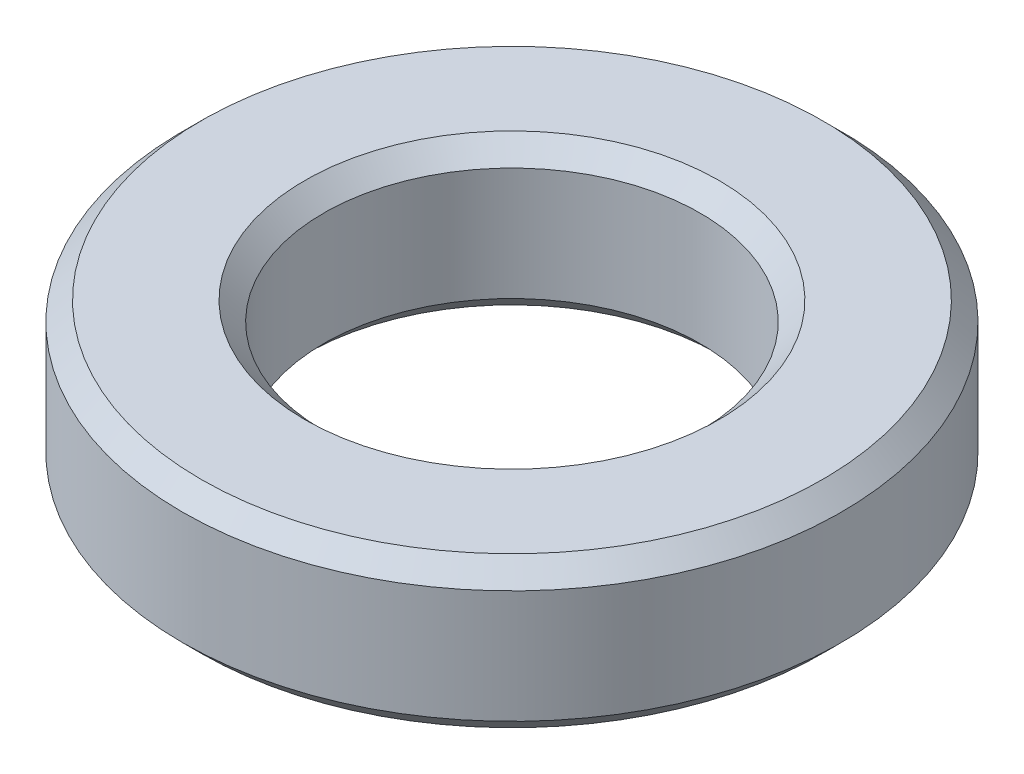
ISO-10303-21;
HEADER;
FILE_DESCRIPTION(('STEP AP214'),'2;1');
FILE_NAME('part.step','',(''),(''),'','','');
FILE_SCHEMA(('AUTOMOTIVE_DESIGN { 1 0 10303 214 1 1 1 1 }'));
ENDSEC;
DATA;
#1=APPLICATION_CONTEXT('core data for automotive mechanical design processes');
#2=APPLICATION_PROTOCOL_DEFINITION('international standard','automotive_design',2000,#1);
#3=PRODUCT_CONTEXT('',#1,'mechanical');
#4=PRODUCT('Part','Part','',(#3));
#5=PRODUCT_RELATED_PRODUCT_CATEGORY('part','',(#4));
#6=PRODUCT_DEFINITION_FORMATION('','',#4);
#7=PRODUCT_DEFINITION_CONTEXT('part definition',#1,'design');
#8=PRODUCT_DEFINITION('design','',#6,#7);
#9=PRODUCT_DEFINITION_SHAPE('','',#8);
#10=(LENGTH_UNIT() NAMED_UNIT(*) SI_UNIT(.MILLI.,.METRE.));
#11=(NAMED_UNIT(*) PLANE_ANGLE_UNIT() SI_UNIT($,.RADIAN.));
#12=(NAMED_UNIT(*) SI_UNIT($,.STERADIAN.) SOLID_ANGLE_UNIT());
#13=UNCERTAINTY_MEASURE_WITH_UNIT(LENGTH_MEASURE(1.E-05),#10,'distance_accuracy_value','');
#14=(GEOMETRIC_REPRESENTATION_CONTEXT(3) GLOBAL_UNCERTAINTY_ASSIGNED_CONTEXT((#13)) GLOBAL_UNIT_ASSIGNED_CONTEXT((#10,
#11,#12)) REPRESENTATION_CONTEXT('',''));
#15=CARTESIAN_POINT('',(0.,0.,0.));
#16=DIRECTION('',(0.,0.,1.));
#17=DIRECTION('',(1.,0.,0.));
#18=AXIS2_PLACEMENT_3D('',#15,#16,#17);
#19=CARTESIAN_POINT('',(0.,1.6,0.));
#20=DIRECTION('',(0.,1.,0.));
#21=DIRECTION('',(0.,0.,1.));
#22=AXIS2_PLACEMENT_3D('',#19,#20,#21);
#23=PLANE('',#22);
#24=CARTESIAN_POINT('',(0.,1.6,0.));
#25=DIRECTION('',(0.,1.,0.));
#26=DIRECTION('',(0.,0.,1.));
#27=AXIS2_PLACEMENT_3D('',#24,#25,#26);
#28=CIRCLE('',#27,2.2);
#29=CARTESIAN_POINT('',(0.,1.6,2.2));
#30=VERTEX_POINT('',#29);
#31=EDGE_CURVE('E51',#30,#30,#28,.F.);
#32=ORIENTED_EDGE('',*,*,#31,.T.);
#33=EDGE_LOOP('',(#32));
#34=FACE_BOUND('',#33,.T.);
#35=CARTESIAN_POINT('',(0.,1.6,0.));
#36=DIRECTION('',(0.,1.,0.));
#37=DIRECTION('',(0.,0.,1.));
#38=AXIS2_PLACEMENT_3D('',#35,#36,#37);
#39=CIRCLE('',#38,3.3);
#40=CARTESIAN_POINT('',(0.,1.6,3.3));
#41=VERTEX_POINT('',#40);
#42=EDGE_CURVE('E54',#41,#41,#39,.T.);
#43=ORIENTED_EDGE('',*,*,#42,.T.);
#44=EDGE_LOOP('',(#43));
#45=FACE_BOUND('',#44,.T.);
#46=ADVANCED_FACE('F31',(#34,#45),#23,.T.);
#47=CARTESIAN_POINT('',(0.,0.,0.));
#48=DIRECTION('',(0.,1.,0.));
#49=DIRECTION('',(0.,0.,1.));
#50=AXIS2_PLACEMENT_3D('',#47,#48,#49);
#51=PLANE('',#50);
#52=CARTESIAN_POINT('',(0.,0.,0.));
#53=DIRECTION('',(0.,1.,0.));
#54=DIRECTION('',(0.,0.,1.));
#55=AXIS2_PLACEMENT_3D('',#52,#53,#54);
#56=CIRCLE('',#55,3.3);
#57=CARTESIAN_POINT('',(0.,0.,3.3));
#58=VERTEX_POINT('',#57);
#59=EDGE_CURVE('E10',#58,#58,#56,.F.);
#60=ORIENTED_EDGE('',*,*,#59,.T.);
#61=EDGE_LOOP('',(#60));
#62=FACE_BOUND('',#61,.T.);
#63=CARTESIAN_POINT('',(0.,0.,0.));
#64=DIRECTION('',(0.,1.,0.));
#65=DIRECTION('',(0.,0.,1.));
#66=AXIS2_PLACEMENT_3D('',#63,#64,#65);
#67=CIRCLE('',#66,2.2);
#68=CARTESIAN_POINT('',(0.,0.,2.2));
#69=VERTEX_POINT('',#68);
#70=EDGE_CURVE('E38',#69,#69,#67,.T.);
#71=ORIENTED_EDGE('',*,*,#70,.T.);
#72=EDGE_LOOP('',(#71));
#73=FACE_BOUND('',#72,.T.);
#74=ADVANCED_FACE('F75',(#62,#73),#51,.F.);
#75=CARTESIAN_POINT('',(0.,1.6,0.));
#76=DIRECTION('',(0.,-1.,0.));
#77=DIRECTION('',(0.,0.,-1.));
#78=AXIS2_PLACEMENT_3D('',#75,#76,#77);
#79=CYLINDRICAL_SURFACE('',#78,3.5);
#80=CARTESIAN_POINT('',(0.,1.4,0.));
#81=DIRECTION('',(0.,1.,0.));
#82=DIRECTION('',(0.,0.,1.));
#83=AXIS2_PLACEMENT_3D('',#80,#81,#82);
#84=CIRCLE('',#83,3.5);
#85=CARTESIAN_POINT('',(0.,1.4,3.5));
#86=VERTEX_POINT('',#85);
#87=EDGE_CURVE('E42',#86,#86,#84,.F.);
#88=ORIENTED_EDGE('',*,*,#87,.T.);
#89=EDGE_LOOP('',(#88));
#90=FACE_BOUND('',#89,.T.);
#91=CARTESIAN_POINT('',(0.,0.200000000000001,0.));
#92=DIRECTION('',(0.,1.,0.));
#93=DIRECTION('',(0.,0.,1.));
#94=AXIS2_PLACEMENT_3D('',#91,#92,#93);
#95=CIRCLE('',#94,3.5);
#96=CARTESIAN_POINT('',(0.,0.200000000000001,3.5));
#97=VERTEX_POINT('',#96);
#98=EDGE_CURVE('E46',#97,#97,#95,.T.);
#99=ORIENTED_EDGE('',*,*,#98,.T.);
#100=EDGE_LOOP('',(#99));
#101=FACE_BOUND('',#100,.T.);
#102=ADVANCED_FACE('F81',(#90,#101),#79,.T.);
#103=CARTESIAN_POINT('',(0.,1.6,0.));
#104=DIRECTION('',(0.,-1.,0.));
#105=DIRECTION('',(0.,0.,-1.));
#106=AXIS2_PLACEMENT_3D('',#103,#104,#105);
#107=CYLINDRICAL_SURFACE('',#106,2.);
#108=CARTESIAN_POINT('',(0.,1.4,0.));
#109=DIRECTION('',(0.,1.,0.));
#110=DIRECTION('',(0.,0.,1.));
#111=AXIS2_PLACEMENT_3D('',#108,#109,#110);
#112=CIRCLE('',#111,2.);
#113=CARTESIAN_POINT('',(0.,1.4,2.));
#114=VERTEX_POINT('',#113);
#115=EDGE_CURVE('E57',#114,#114,#112,.T.);
#116=ORIENTED_EDGE('',*,*,#115,.T.);
#117=EDGE_LOOP('',(#116));
#118=FACE_BOUND('',#117,.T.);
#119=CARTESIAN_POINT('',(0.,0.200000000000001,0.));
#120=DIRECTION('',(0.,1.,0.));
#121=DIRECTION('',(0.,0.,1.));
#122=AXIS2_PLACEMENT_3D('',#119,#120,#121);
#123=CIRCLE('',#122,2.);
#124=CARTESIAN_POINT('',(0.,0.200000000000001,2.));
#125=VERTEX_POINT('',#124);
#126=EDGE_CURVE('E60',#125,#125,#123,.F.);
#127=ORIENTED_EDGE('',*,*,#126,.T.);
#128=EDGE_LOOP('',(#127));
#129=FACE_BOUND('',#128,.T.);
#130=ADVANCED_FACE('F64',(#118,#129),#107,.F.);
#131=CARTESIAN_POINT('',(0.,1.4,0.));
#132=DIRECTION('',(0.,1.,0.));
#133=DIRECTION('',(0.,0.,1.));
#134=AXIS2_PLACEMENT_3D('',#131,#132,#133);
#135=CONICAL_SURFACE('',#134,2.,0.785398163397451);
#136=CARTESIAN_POINT('',(0.,1.6,2.2));
#137=CARTESIAN_POINT('',(0.,1.59791666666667,2.19791666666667));
#138=CARTESIAN_POINT('',(0.,1.59583333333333,2.19583333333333));
#139=CARTESIAN_POINT('',(0.,1.59166666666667,2.19166666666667));
#140=CARTESIAN_POINT('',(0.,1.58958333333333,2.18958333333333));
#141=CARTESIAN_POINT('',(0.,1.58541666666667,2.18541666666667));
#142=CARTESIAN_POINT('',(0.,1.58333333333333,2.18333333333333));
#143=CARTESIAN_POINT('',(0.,1.57916666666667,2.17916666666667));
#144=CARTESIAN_POINT('',(0.,1.57708333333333,2.17708333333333));
#145=CARTESIAN_POINT('',(0.,1.57291666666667,2.17291666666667));
#146=CARTESIAN_POINT('',(0.,1.57083333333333,2.17083333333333));
#147=CARTESIAN_POINT('',(0.,1.56666666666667,2.16666666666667));
#148=CARTESIAN_POINT('',(0.,1.56458333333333,2.16458333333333));
#149=CARTESIAN_POINT('',(0.,1.56041666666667,2.16041666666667));
#150=CARTESIAN_POINT('',(0.,1.55833333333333,2.15833333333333));
#151=CARTESIAN_POINT('',(0.,1.55416666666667,2.15416666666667));
#152=CARTESIAN_POINT('',(0.,1.55208333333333,2.15208333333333));
#153=CARTESIAN_POINT('',(0.,1.54791666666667,2.14791666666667));
#154=CARTESIAN_POINT('',(0.,1.54583333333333,2.14583333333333));
#155=CARTESIAN_POINT('',(0.,1.54166666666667,2.14166666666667));
#156=CARTESIAN_POINT('',(0.,1.53958333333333,2.13958333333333));
#157=CARTESIAN_POINT('',(0.,1.53541666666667,2.13541666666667));
#158=CARTESIAN_POINT('',(0.,1.53333333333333,2.13333333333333));
#159=CARTESIAN_POINT('',(0.,1.52916666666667,2.12916666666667));
#160=CARTESIAN_POINT('',(0.,1.52708333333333,2.12708333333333));
#161=CARTESIAN_POINT('',(0.,1.52291666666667,2.12291666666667));
#162=CARTESIAN_POINT('',(0.,1.52083333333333,2.12083333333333));
#163=CARTESIAN_POINT('',(0.,1.51666666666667,2.11666666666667));
#164=CARTESIAN_POINT('',(0.,1.51458333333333,2.11458333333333));
#165=CARTESIAN_POINT('',(0.,1.51041666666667,2.11041666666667));
#166=CARTESIAN_POINT('',(0.,1.50833333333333,2.10833333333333));
#167=CARTESIAN_POINT('',(0.,1.50416666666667,2.10416666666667));
#168=CARTESIAN_POINT('',(0.,1.50208333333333,2.10208333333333));
#169=CARTESIAN_POINT('',(0.,1.49791666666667,2.09791666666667));
#170=CARTESIAN_POINT('',(0.,1.49583333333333,2.09583333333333));
#171=CARTESIAN_POINT('',(0.,1.49166666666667,2.09166666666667));
#172=CARTESIAN_POINT('',(0.,1.48958333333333,2.08958333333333));
#173=CARTESIAN_POINT('',(0.,1.48541666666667,2.08541666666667));
#174=CARTESIAN_POINT('',(0.,1.48333333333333,2.08333333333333));
#175=CARTESIAN_POINT('',(0.,1.47916666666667,2.07916666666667));
#176=CARTESIAN_POINT('',(0.,1.47708333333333,2.07708333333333));
#177=CARTESIAN_POINT('',(0.,1.47291666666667,2.07291666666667));
#178=CARTESIAN_POINT('',(0.,1.47083333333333,2.07083333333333));
#179=CARTESIAN_POINT('',(0.,1.46666666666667,2.06666666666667));
#180=CARTESIAN_POINT('',(0.,1.46458333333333,2.06458333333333));
#181=CARTESIAN_POINT('',(0.,1.46041666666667,2.06041666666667));
#182=CARTESIAN_POINT('',(0.,1.45833333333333,2.05833333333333));
#183=CARTESIAN_POINT('',(0.,1.45416666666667,2.05416666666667));
#184=CARTESIAN_POINT('',(0.,1.45208333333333,2.05208333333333));
#185=CARTESIAN_POINT('',(0.,1.44791666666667,2.04791666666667));
#186=CARTESIAN_POINT('',(0.,1.44583333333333,2.04583333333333));
#187=CARTESIAN_POINT('',(0.,1.44166666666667,2.04166666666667));
#188=CARTESIAN_POINT('',(0.,1.43958333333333,2.03958333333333));
#189=CARTESIAN_POINT('',(0.,1.43541666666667,2.03541666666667));
#190=CARTESIAN_POINT('',(0.,1.43333333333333,2.03333333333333));
#191=CARTESIAN_POINT('',(0.,1.42916666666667,2.02916666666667));
#192=CARTESIAN_POINT('',(0.,1.42708333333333,2.02708333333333));
#193=CARTESIAN_POINT('',(0.,1.42291666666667,2.02291666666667));
#194=CARTESIAN_POINT('',(0.,1.42083333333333,2.02083333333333));
#195=CARTESIAN_POINT('',(0.,1.41666666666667,2.01666666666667));
#196=CARTESIAN_POINT('',(0.,1.41458333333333,2.01458333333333));
#197=CARTESIAN_POINT('',(0.,1.41041666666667,2.01041666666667));
#198=CARTESIAN_POINT('',(0.,1.40833333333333,2.00833333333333));
#199=CARTESIAN_POINT('',(0.,1.40416666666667,2.00416666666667));
#200=CARTESIAN_POINT('',(0.,1.40208333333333,2.00208333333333));
#201=CARTESIAN_POINT('',(0.,1.4,2.));
#202=B_SPLINE_CURVE_WITH_KNOTS('',3,(#136,#137,#138,#139,#140,#141,#142,#143,#144,#145,#146,
#147,#148,#149,#150,#151,#152,#153,#154,#155,#156,#157,#158,#159,#160,#161,#162,#163,#164,#165,
#166,#167,#168,#169,#170,#171,#172,#173,#174,#175,#176,#177,#178,#179,#180,#181,#182,#183,#184,
#185,#186,#187,#188,#189,#190,#191,#192,#193,#194,#195,#196,#197,#198,#199,#200,#201),
.UNSPECIFIED.,.F.,.F.,(4,2,2,2,2,2,2,2,2,2,2,2,2,2,2,2,2,2,2,2,2,2,2,2,2,2,2,2,2,2,2,2,4),(0.,
0.00883883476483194,0.0176776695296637,0.0265165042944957,0.0353553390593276,0.0441941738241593,
0.0530330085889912,0.0618718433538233,0.0707106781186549,0.0795495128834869,0.0883883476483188,
0.0972271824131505,0.106066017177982,0.114904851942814,0.123743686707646,0.132582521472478,
0.14142135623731,0.150260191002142,0.159099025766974,0.167937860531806,0.176776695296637,
0.185615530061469,0.194454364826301,0.203293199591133,0.212132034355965,0.220970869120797,
0.229809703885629,0.23864853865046,0.247487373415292,0.256326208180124,0.265165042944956,
0.274003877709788,0.28284271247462),.UNSPECIFIED.);
#203=EDGE_CURVE('BSEAM89',#30,#114,#202,.T.);
#204=ORIENTED_EDGE('',*,*,#31,.F.);
#205=ORIENTED_EDGE('',*,*,#115,.F.);
#206=ORIENTED_EDGE('',*,*,#203,.T.);
#207=ORIENTED_EDGE('',*,*,#203,.F.);
#208=EDGE_LOOP('',(#204,#206,#205,#207));
#209=FACE_BOUND('',#208,.T.);
#210=ADVANCED_FACE('F89',(#209),#135,.F.);
#211=CARTESIAN_POINT('',(0.,1.6,0.));
#212=DIRECTION('',(0.,-1.,0.));
#213=DIRECTION('',(0.,0.,-1.));
#214=AXIS2_PLACEMENT_3D('',#211,#212,#213);
#215=CONICAL_SURFACE('',#214,3.3,0.785398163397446);
#216=ORIENTED_EDGE('',*,*,#87,.F.);
#217=EDGE_LOOP('',(#216));
#218=FACE_BOUND('',#217,.T.);
#219=ORIENTED_EDGE('',*,*,#42,.F.);
#220=EDGE_LOOP('',(#219));
#221=FACE_BOUND('',#220,.T.);
#222=ADVANCED_FACE('F72',(#218,#221),#215,.T.);
#223=CARTESIAN_POINT('',(0.,0.200000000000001,0.));
#224=DIRECTION('',(0.,1.,0.));
#225=DIRECTION('',(0.,0.,1.));
#226=AXIS2_PLACEMENT_3D('',#223,#224,#225);
#227=CONICAL_SURFACE('',#226,3.5,0.78539816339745);
#228=ORIENTED_EDGE('',*,*,#59,.F.);
#229=EDGE_LOOP('',(#228));
#230=FACE_BOUND('',#229,.T.);
#231=ORIENTED_EDGE('',*,*,#98,.F.);
#232=EDGE_LOOP('',(#231));
#233=FACE_BOUND('',#232,.T.);
#234=ADVANCED_FACE('F68',(#230,#233),#227,.T.);
#235=CARTESIAN_POINT('',(0.,0.,0.));
#236=DIRECTION('',(0.,-1.,0.));
#237=DIRECTION('',(0.,0.,-1.));
#238=AXIS2_PLACEMENT_3D('',#235,#236,#237);
#239=CONICAL_SURFACE('',#238,2.2,0.785398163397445);
#240=ORIENTED_EDGE('',*,*,#126,.F.);
#241=EDGE_LOOP('',(#240));
#242=FACE_BOUND('',#241,.T.);
#243=ORIENTED_EDGE('',*,*,#70,.F.);
#244=EDGE_LOOP('',(#243));
#245=FACE_BOUND('',#244,.T.);
#246=ADVANCED_FACE('F33',(#242,#245),#239,.F.);
#247=CLOSED_SHELL('',(#46,#74,#102,#130,#210,#222,#234,#246));
#248=MANIFOLD_SOLID_BREP('B2',#247);
#249=ADVANCED_BREP_SHAPE_REPRESENTATION('',(#18,#248),#14);
#250=SHAPE_DEFINITION_REPRESENTATION(#9,#249);
ENDSEC;
END-ISO-10303-21;
